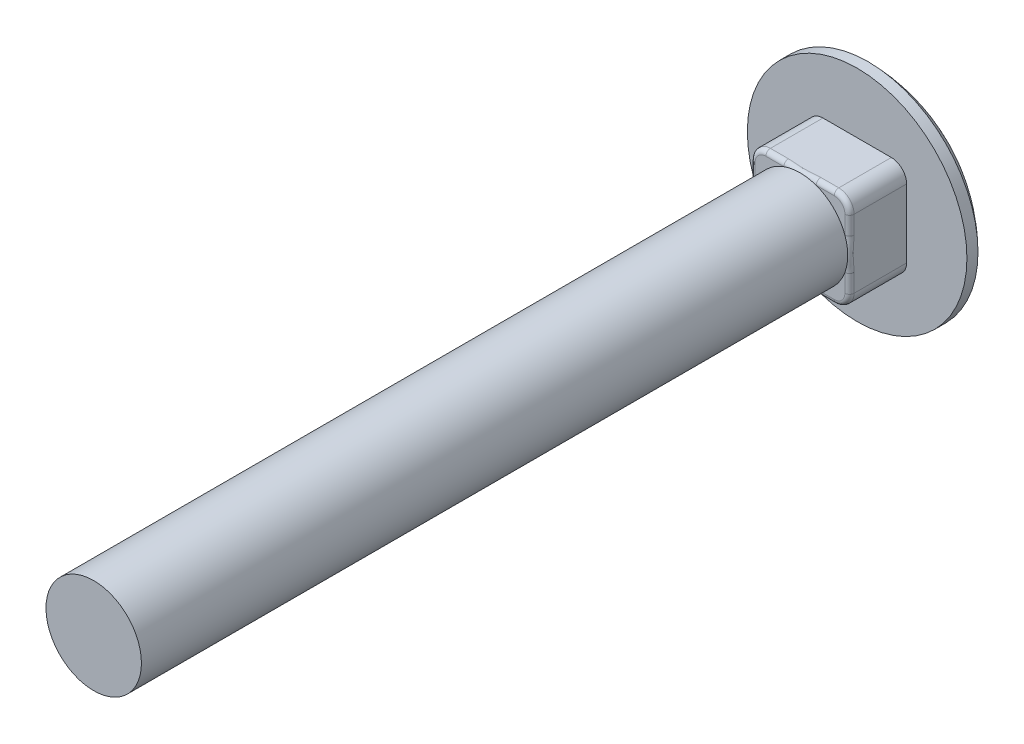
from build123d import *

# Parameters (mm, degrees)
SKETCH2_W      = 8.2296
SKETCH2_H      = 8.2296
EXTRUDE1_DEPTH = 4.7498
SKETCH3_R      = 3.96875
EXTRUDE2_DEPTH = 58.74258
FILLET1_R      = 1.27
FILLET2_R      = 0.381


with BuildPart() as part:
    # Sketch1 → Revolve1 (revolve)
    with BuildSketch(Plane(origin=(0, 0, 0), x_dir=(0, 0, -1), z_dir=(1, 0, 0)), mode=Mode.PRIVATE) as revolve1_sk:
        with BuildLine():
            Line((0, 0), (4.4704, 0))
            ThreePointArc((4.4704, 0), (3.611515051, 4.921707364), (0.92075, 9.1313))
            Line((0.92075, 9.1313), (0, 9.1313))
            Line((0, 9.1313), (0, 0))
        make_face()
    revolve(revolve1_sk.sketch.rotate(Axis((0, 0, 0), (0, 0, -1)), 90), axis=Axis((0, 0, 0), (0, 0, -1)))

    # Sketch2 → Extrude1 (add)
    with BuildSketch(Plane.XY):
        Rectangle(SKETCH2_W, SKETCH2_H)
    extrude(amount=EXTRUDE1_DEPTH)

    # Sketch3 → Extrude2 (add)
    with BuildSketch(Plane.XY.offset(4.7498)):
        with Locations(Location((0, 0, 0), (0, 0, 180))):
            Circle(SKETCH3_R)
    extrude(amount=EXTRUDE2_DEPTH)

    # Fillet1
    fillet1_edges = [part.edges().sort_by_distance(p)[0] for p in [
        (-4.1148, 4.1148, 2.3749),
        (-4.1148, -4.1148, 2.3749),
        (4.1148, -4.1148, 2.3749),
        (4.1148, 4.1148, 2.3749),
    ]]
    fillet(fillet1_edges, radius=FILLET1_R)

    # Fillet2
    fillet2_edges = [part.edges().sort_by_distance(p)[0] for p in [
        (-4.1148, 0, 4.7498),
        (0, 4.1148, 4.7498),
        (0, -4.1148, 4.7498),
        (4.1148, 0, 4.7498),
        (3.742825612, 3.742825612, 4.7498),
        (3.742825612, -3.742825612, 4.7498),
        (-3.742825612, -3.742825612, 4.7498),
        (-3.742825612, 3.742825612, 4.7498),
    ]]
    fillet(fillet2_edges, radius=FILLET2_R)


solid = part.part
